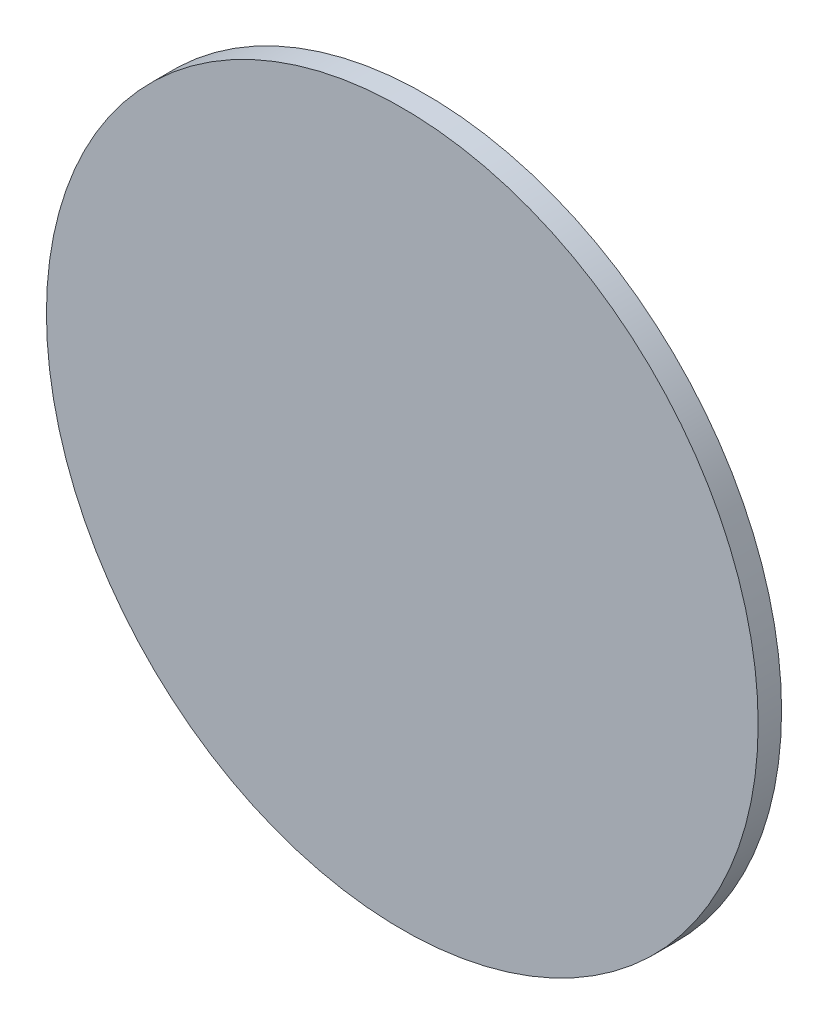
from build123d import *

# Parameters (mm, degrees)
CROQUIS1_R              = 76
SALIENTE_EXTRUIR1_DEPTH = 5


with BuildPart() as part:
    # Croquis1 → Saliente-Extruir1 (new body)
    with BuildSketch(Plane.XY):
        Circle(CROQUIS1_R)
    extrude(amount=SALIENTE_EXTRUIR1_DEPTH)


solid = part.part
